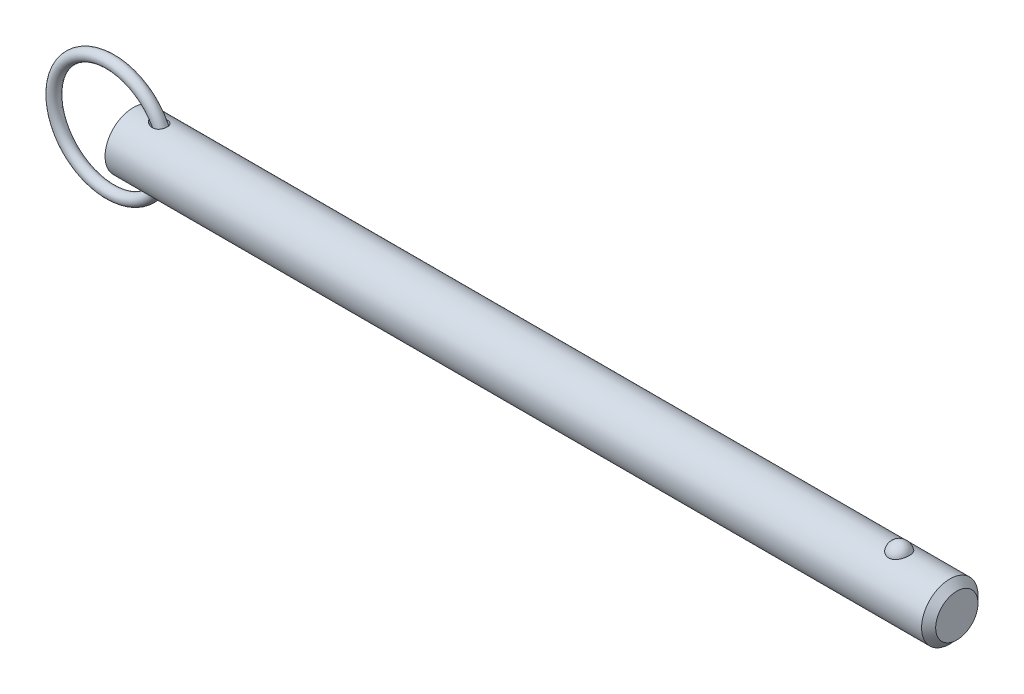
ISO-10303-21;
HEADER;
FILE_DESCRIPTION(('STEP AP214'),'2;1');
FILE_NAME('part.step','',(''),(''),'','','');
FILE_SCHEMA(('AUTOMOTIVE_DESIGN { 1 0 10303 214 1 1 1 1 }'));
ENDSEC;
DATA;
#1=APPLICATION_CONTEXT('core data for automotive mechanical design processes');
#2=APPLICATION_PROTOCOL_DEFINITION('international standard','automotive_design',2000,#1);
#3=PRODUCT_CONTEXT('',#1,'mechanical');
#4=PRODUCT('Part','Part','',(#3));
#5=PRODUCT_RELATED_PRODUCT_CATEGORY('part','',(#4));
#6=PRODUCT_DEFINITION_FORMATION('','',#4);
#7=PRODUCT_DEFINITION_CONTEXT('part definition',#1,'design');
#8=PRODUCT_DEFINITION('design','',#6,#7);
#9=PRODUCT_DEFINITION_SHAPE('','',#8);
#10=(LENGTH_UNIT() NAMED_UNIT(*) SI_UNIT(.MILLI.,.METRE.));
#11=(NAMED_UNIT(*) PLANE_ANGLE_UNIT() SI_UNIT($,.RADIAN.));
#12=(NAMED_UNIT(*) SI_UNIT($,.STERADIAN.) SOLID_ANGLE_UNIT());
#13=UNCERTAINTY_MEASURE_WITH_UNIT(LENGTH_MEASURE(1.E-05),#10,'distance_accuracy_value','');
#14=(GEOMETRIC_REPRESENTATION_CONTEXT(3) GLOBAL_UNCERTAINTY_ASSIGNED_CONTEXT((#13)) GLOBAL_UNIT_ASSIGNED_CONTEXT((#10,
#11,#12)) REPRESENTATION_CONTEXT('',''));
#15=CARTESIAN_POINT('',(0.,0.,0.));
#16=DIRECTION('',(0.,0.,1.));
#17=DIRECTION('',(1.,0.,0.));
#18=AXIS2_PLACEMENT_3D('',#15,#16,#17);
#19=CARTESIAN_POINT('',(-6.46799987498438,0.,0.));
#20=DIRECTION('',(0.,0.,1.));
#21=DIRECTION('',(1.,0.,0.));
#22=AXIS2_PLACEMENT_3D('',#19,#20,#21);
#23=TOROIDAL_SURFACE('',#22,15.875,1.588);
#24=CARTESIAN_POINT('',(10.9950001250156,0.,0.));
#25=VERTEX_POINT('',#24);
#26=VERTEX_LOOP('',#25);
#27=FACE_BOUND('',#26,.T.);
#28=ADVANCED_FACE('P0_F12',(#27),#23,.T.);
#29=CLOSED_SHELL('',(#28));
#30=MANIFOLD_SOLID_BREP('P0_B1',#29);
#31=CARTESIAN_POINT('',(0.,0.,0.));
#32=DIRECTION('',(1.,0.,0.));
#33=DIRECTION('',(0.,0.,-1.));
#34=AXIS2_PLACEMENT_3D('',#31,#32,#33);
#35=CYLINDRICAL_SURFACE('',#34,7.94);
#36=CARTESIAN_POINT('',(5.37881269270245,7.8641200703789,-1.0950869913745));
#37=CARTESIAN_POINT('',(5.49078530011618,7.84653010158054,-1.22142628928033));
#38=CARTESIAN_POINT('',(5.61742164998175,7.82766483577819,-1.33478448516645));
#39=CARTESIAN_POINT('',(5.82155225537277,7.80005811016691,-1.48501770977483));
#40=CARTESIAN_POINT('',(5.89211597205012,7.79095331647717,-1.53186949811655));
#41=CARTESIAN_POINT('',(6.03726296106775,7.77331484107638,-1.61899652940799));
#42=CARTESIAN_POINT('',(6.11184478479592,7.76478095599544,-1.65927412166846));
#43=CARTESIAN_POINT('',(6.31831542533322,7.74290334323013,-1.75933205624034));
#44=CARTESIAN_POINT('',(6.45343253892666,7.73042593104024,-1.81276183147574));
#45=CARTESIAN_POINT('',(6.73017339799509,7.70966096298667,-1.89912673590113));
#46=CARTESIAN_POINT('',(6.87179099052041,7.70136953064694,-1.93208083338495));
#47=CARTESIAN_POINT('',(7.17522096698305,7.6896684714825,-1.97820987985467));
#48=CARTESIAN_POINT('',(7.33750100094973,7.68691980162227,-1.98871513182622));
#49=CARTESIAN_POINT('',(7.57994245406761,7.68880305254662,-1.98137951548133));
#50=CARTESIAN_POINT('',(7.66059155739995,7.69043175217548,-1.97508575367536));
#51=CARTESIAN_POINT('',(7.82077465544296,7.69570110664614,-1.95445819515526));
#52=CARTESIAN_POINT('',(7.9003091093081,7.69934090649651,-1.94012781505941));
#53=CARTESIAN_POINT('',(8.09280087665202,7.71066069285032,-1.89475688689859));
#54=CARTESIAN_POINT('',(8.20465204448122,7.71942251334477,-1.85909462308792));
#55=CARTESIAN_POINT('',(8.42059371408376,7.74035594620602,-1.7699066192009));
#56=CARTESIAN_POINT('',(8.52468939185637,7.75252525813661,-1.7163929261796));
#57=CARTESIAN_POINT('',(8.72211003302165,7.77903750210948,-1.59192358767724));
#58=CARTESIAN_POINT('',(8.81539818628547,7.79338749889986,-1.52091076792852));
#59=CARTESIAN_POINT('',(8.98759177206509,7.8225086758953,-1.36321590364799));
#60=CARTESIAN_POINT('',(9.06649712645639,7.83727985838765,-1.27653377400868));
#61=CARTESIAN_POINT('',(9.20311499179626,7.86453692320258,-1.09567667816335));
#62=CARTESIAN_POINT('',(9.26180839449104,7.8771064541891,-1.00225329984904));
#63=CARTESIAN_POINT('',(9.36257622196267,7.89954213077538,-0.8065472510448));
#64=CARTESIAN_POINT('',(9.40465301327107,7.9094086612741,-0.704265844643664));
#65=CARTESIAN_POINT('',(9.47062404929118,7.92520709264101,-0.495461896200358));
#66=CARTESIAN_POINT('',(9.49478817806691,7.9311972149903,-0.389028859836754));
#67=CARTESIAN_POINT('',(9.52544004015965,7.93883641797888,-0.173494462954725));
#68=CARTESIAN_POINT('',(9.5319278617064,7.94048552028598,-0.0643931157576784));
#69=CARTESIAN_POINT('',(9.52707996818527,7.93926454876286,0.153487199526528));
#70=CARTESIAN_POINT('',(9.51572796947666,7.93639034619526,0.26226578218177));
#71=CARTESIAN_POINT('',(9.47542322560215,7.92642470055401,0.476313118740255));
#72=CARTESIAN_POINT('',(9.44647056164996,7.91933327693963,0.581581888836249));
#73=CARTESIAN_POINT('',(9.3716401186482,7.90170355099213,0.785602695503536));
#74=CARTESIAN_POINT('',(9.32576415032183,7.89116561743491,0.884355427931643));
#75=CARTESIAN_POINT('',(9.21823065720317,7.8677977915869,1.07254831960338));
#76=CARTESIAN_POINT('',(9.15657431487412,7.85496807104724,1.16198917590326));
#77=CARTESIAN_POINT('',(9.01919194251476,7.82843688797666,1.32903649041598));
#78=CARTESIAN_POINT('',(8.94347744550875,7.81473614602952,1.40665255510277));
#79=CARTESIAN_POINT('',(8.78012086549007,7.7879321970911,1.5481977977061));
#80=CARTESIAN_POINT('',(8.69247914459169,7.77482897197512,1.61212739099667));
#81=CARTESIAN_POINT('',(8.50642314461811,7.75037063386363,1.72592270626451));
#82=CARTESIAN_POINT('',(8.40786430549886,7.73904540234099,1.77555777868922));
#83=CARTESIAN_POINT('',(8.2039870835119,7.71943979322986,1.85894844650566));
#84=CARTESIAN_POINT('',(8.0986670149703,7.7111601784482,1.89270006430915));
#85=CARTESIAN_POINT('',(7.87703213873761,7.69782475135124,1.94625652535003));
#86=CARTESIAN_POINT('',(7.76044899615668,7.69301557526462,1.96500324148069));
#87=CARTESIAN_POINT('',(7.52574256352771,7.68770484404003,1.98567257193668));
#88=CARTESIAN_POINT('',(7.40761868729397,7.68720497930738,1.98758858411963));
#89=CARTESIAN_POINT('',(7.15639592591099,7.69044495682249,1.97502233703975));
#90=CARTESIAN_POINT('',(7.02341871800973,7.69476380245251,1.9583009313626));
#91=CARTESIAN_POINT('',(6.7612589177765,7.70776394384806,1.90648094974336));
#92=CARTESIAN_POINT('',(6.6320804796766,7.71644984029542,1.87136299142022));
#93=CARTESIAN_POINT('',(6.35978215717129,7.73875442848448,1.77707737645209));
#94=CARTESIAN_POINT('',(6.2177212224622,7.75293863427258,1.71496895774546));
#95=CARTESIAN_POINT('',(5.94559201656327,7.78383102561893,1.56880760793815));
#96=CARTESIAN_POINT('',(5.81552062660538,7.80053855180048,1.48476040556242));
#97=CARTESIAN_POINT('',(5.60081087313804,7.83035955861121,1.31701356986));
#98=CARTESIAN_POINT('',(5.51265224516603,7.84340226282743,1.23780647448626));
#99=CARTESIAN_POINT('',(5.34976240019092,7.86852524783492,1.06647953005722));
#100=CARTESIAN_POINT('',(5.27500719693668,7.88060722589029,0.974383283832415));
#101=CARTESIAN_POINT('',(5.15877594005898,7.89990441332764,0.800548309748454));
#102=CARTESIAN_POINT('',(5.11360209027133,7.90759876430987,0.721348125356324));
#103=CARTESIAN_POINT('',(5.03655060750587,7.92090267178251,0.556518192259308));
#104=CARTESIAN_POINT('',(5.00466157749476,7.92651401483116,0.470894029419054));
#105=CARTESIAN_POINT('',(4.95653766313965,7.93503671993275,0.294356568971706));
#106=CARTESIAN_POINT('',(4.94043621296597,7.93792505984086,0.203404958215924));
#107=CARTESIAN_POINT('',(4.92605720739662,7.94050250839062,0.0200631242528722));
#108=CARTESIAN_POINT('',(4.92776929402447,7.9401934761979,-0.072326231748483));
#109=CARTESIAN_POINT('',(4.94742735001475,7.93667454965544,-0.24325091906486));
#110=CARTESIAN_POINT('',(4.96327131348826,7.93384031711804,-0.32204819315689));
#111=CARTESIAN_POINT('',(5.00707570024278,7.92609115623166,-0.47605810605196));
#112=CARTESIAN_POINT('',(5.0350396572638,7.92117562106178,-0.551269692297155));
#113=CARTESIAN_POINT('',(5.10737112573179,7.90866290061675,-0.70999547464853));
#114=CARTESIAN_POINT('',(5.15379379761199,7.90074105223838,-0.792541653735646));
#115=CARTESIAN_POINT('',(5.2582083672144,7.88338732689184,-0.949781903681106));
#116=CARTESIAN_POINT('',(5.31621941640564,7.87395295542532,-1.02446265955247));
#117=CARTESIAN_POINT('',(5.37881269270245,7.8641200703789,-1.0950869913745));
#118=B_SPLINE_CURVE_WITH_KNOTS('',3,(#36,#37,#38,#39,#40,#41,#42,#43,#44,#45,#46,#47,#48,#49,
#50,#51,#52,#53,#54,#55,#56,#57,#58,#59,#60,#61,#62,#63,#64,#65,#66,#67,#68,#69,#70,#71,#72,#73,
#74,#75,#76,#77,#78,#79,#80,#81,#82,#83,#84,#85,#86,#87,#88,#89,#90,#91,#92,#93,#94,#95,#96,#97,
#98,#99,#100,#101,#102,#103,#104,#105,#106,#107,#108,#109,#110,#111,#112,#113,#114,#115,#116,
#117),.UNSPECIFIED.,.T.,.F.,(4,2,2,2,2,2,2,2,2,2,2,2,2,2,2,2,2,2,2,2,2,2,2,2,2,2,2,2,2,2,2,2,2,
2,2,2,2,2,2,2,4),(0.,0.508599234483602,0.763935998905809,1.01918131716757,1.45492798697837,
1.89027038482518,2.37502798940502,2.61739702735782,2.8596631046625,3.21120678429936,
3.56251370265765,3.91498401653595,4.26745624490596,4.59897839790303,4.93045331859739,
5.2568264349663,5.58319792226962,5.909867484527,6.23653553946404,6.56316865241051,
6.88977729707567,7.21611917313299,7.54245114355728,7.87378632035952,8.20520442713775,
8.55832700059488,8.91158808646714,9.31234018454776,9.71351536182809,10.1786231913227,
10.6436096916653,11.0001264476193,11.3559986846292,11.6294791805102,11.9027245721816,
12.1782599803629,12.4536351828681,12.693828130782,12.9340911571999,13.2179277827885,
13.5022374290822),.UNSPECIFIED.);
#119=CARTESIAN_POINT('',(5.37881269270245,7.8641200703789,-1.0950869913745));
#120=VERTEX_POINT('',#119);
#121=EDGE_CURVE('P1_E40',#120,#120,#118,.T.);
#122=ORIENTED_EDGE('',*,*,#121,.T.);
#123=EDGE_LOOP('',(#122));
#124=FACE_BOUND('',#123,.T.);
#125=CARTESIAN_POINT('',(229.795,0.,0.));
#126=DIRECTION('',(1.,0.,0.));
#127=DIRECTION('',(0.,0.,-1.));
#128=AXIS2_PLACEMENT_3D('',#125,#126,#127);
#129=CIRCLE('',#128,7.94);
#130=CARTESIAN_POINT('',(229.795,0.,-7.94));
#131=VERTEX_POINT('',#130);
#132=EDGE_CURVE('P1_E25',#131,#131,#129,.T.);
#133=ORIENTED_EDGE('',*,*,#132,.F.);
#134=EDGE_LOOP('',(#133));
#135=FACE_BOUND('',#134,.T.);
#136=CARTESIAN_POINT('',(0.,0.,0.));
#137=DIRECTION('',(1.,0.,0.));
#138=DIRECTION('',(0.,0.,-1.));
#139=AXIS2_PLACEMENT_3D('',#136,#137,#138);
#140=CIRCLE('',#139,7.94);
#141=CARTESIAN_POINT('',(0.,0.,-7.94));
#142=VERTEX_POINT('',#141);
#143=EDGE_CURVE('P1_E9',#142,#142,#140,.T.);
#144=ORIENTED_EDGE('',*,*,#143,.T.);
#145=EDGE_LOOP('',(#144));
#146=FACE_BOUND('',#145,.T.);
#147=CARTESIAN_POINT('',(215.564907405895,7.37767842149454,2.93486986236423));
#148=CARTESIAN_POINT('',(215.412749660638,7.3776732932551,2.93487505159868));
#149=CARTESIAN_POINT('',(215.260632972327,7.38258419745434,2.92262454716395));
#150=CARTESIAN_POINT('',(214.960928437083,7.40163229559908,2.87404196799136));
#151=CARTESIAN_POINT('',(214.813339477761,7.41576720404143,2.83771585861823));
#152=CARTESIAN_POINT('',(214.527018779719,7.45161576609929,2.74218769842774));
#153=CARTESIAN_POINT('',(214.388274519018,7.47331841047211,2.68301886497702));
#154=CARTESIAN_POINT('',(214.122882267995,7.52194082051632,2.54350967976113));
#155=CARTESIAN_POINT('',(213.996236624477,7.54886159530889,2.46316523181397));
#156=CARTESIAN_POINT('',(213.754534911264,7.60594671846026,2.28090375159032));
#157=CARTESIAN_POINT('',(213.639906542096,7.63618114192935,2.1784421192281));
#158=CARTESIAN_POINT('',(213.428878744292,7.69614046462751,1.95608495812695));
#159=CARTESIAN_POINT('',(213.332482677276,7.72586526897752,1.83618622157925));
#160=CARTESIAN_POINT('',(213.155938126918,7.78314821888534,1.57628086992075));
#161=CARTESIAN_POINT('',(213.076707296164,7.81055035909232,1.43561546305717));
#162=CARTESIAN_POINT('',(212.941797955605,7.85879631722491,1.142363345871));
#163=CARTESIAN_POINT('',(212.886121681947,7.87963951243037,0.989775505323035));
#164=CARTESIAN_POINT('',(212.79881215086,7.91289645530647,0.674619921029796));
#165=CARTESIAN_POINT('',(212.76753090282,7.92518652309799,0.511941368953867));
#166=CARTESIAN_POINT('',(212.730975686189,7.93958930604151,0.18324773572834));
#167=CARTESIAN_POINT('',(212.725701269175,7.94170219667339,0.017232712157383));
#168=CARTESIAN_POINT('',(212.741231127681,7.93554931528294,-0.31267286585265));
#169=CARTESIAN_POINT('',(212.761925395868,7.92732732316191,-0.476569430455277));
#170=CARTESIAN_POINT('',(212.82878655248,7.90141534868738,-0.798305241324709));
#171=CARTESIAN_POINT('',(212.874953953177,7.88372517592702,-0.956144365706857));
#172=CARTESIAN_POINT('',(212.991898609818,7.84066230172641,-1.26152073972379));
#173=CARTESIAN_POINT('',(213.062704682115,7.81528060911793,-1.40904568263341));
#174=CARTESIAN_POINT('',(213.227478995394,7.75948672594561,-1.68950598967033));
#175=CARTESIAN_POINT('',(213.321448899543,7.72907417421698,-1.82244030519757));
#176=CARTESIAN_POINT('',(213.530839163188,7.66640424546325,-2.07032792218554));
#177=CARTESIAN_POINT('',(213.646315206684,7.63414223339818,-2.18523308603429));
#178=CARTESIAN_POINT('',(213.8959006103,7.57149681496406,-2.39329737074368));
#179=CARTESIAN_POINT('',(214.030008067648,7.54111321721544,-2.48645870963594));
#180=CARTESIAN_POINT('',(214.310111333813,7.48650742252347,-2.64628132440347));
#181=CARTESIAN_POINT('',(214.455760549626,7.46215900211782,-2.71350554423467));
#182=CARTESIAN_POINT('',(214.757425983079,7.42171253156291,-2.82226614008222));
#183=CARTESIAN_POINT('',(214.913438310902,7.40561140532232,-2.86381209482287));
#184=CARTESIAN_POINT('',(215.222970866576,7.3842679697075,-2.9183907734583));
#185=CARTESIAN_POINT('',(215.376222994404,7.37852109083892,-2.93275024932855));
#186=CARTESIAN_POINT('',(215.683070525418,7.37700973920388,-2.93655208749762));
#187=CARTESIAN_POINT('',(215.836665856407,7.38124333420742,-2.92599927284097));
#188=CARTESIAN_POINT('',(216.134990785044,7.39890635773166,-2.88102897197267));
#189=CARTESIAN_POINT('',(216.279848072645,7.41205491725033,-2.84733999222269));
#190=CARTESIAN_POINT('',(216.56164329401,7.445801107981,-2.75788206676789));
#191=CARTESIAN_POINT('',(216.698580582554,7.46639934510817,-2.70211132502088));
#192=CARTESIAN_POINT('',(216.964061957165,7.51339098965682,-2.56858908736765));
#193=CARTESIAN_POINT('',(217.092354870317,7.53990200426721,-2.4903806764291));
#194=CARTESIAN_POINT('',(217.334244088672,7.59569503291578,-2.31462737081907));
#195=CARTESIAN_POINT('',(217.447837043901,7.6249776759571,-2.21707808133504));
#196=CARTESIAN_POINT('',(217.66322156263,7.68489473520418,-1.99982049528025));
#197=CARTESIAN_POINT('',(217.764148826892,7.71552419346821,-1.87925337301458));
#198=CARTESIAN_POINT('',(217.945186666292,7.77353016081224,-1.6226882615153));
#199=CARTESIAN_POINT('',(218.025293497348,7.80090608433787,-1.48668750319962));
#200=CARTESIAN_POINT('',(218.165361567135,7.85047992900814,-1.1981841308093));
#201=CARTESIAN_POINT('',(218.224587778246,7.87248183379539,-1.04529016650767));
#202=CARTESIAN_POINT('',(218.317982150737,7.90785114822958,-0.731080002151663));
#203=CARTESIAN_POINT('',(218.352149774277,7.92121837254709,-0.56976362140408));
#204=CARTESIAN_POINT('',(218.394795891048,7.93797834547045,-0.242812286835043));
#205=CARTESIAN_POINT('',(218.403204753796,7.94134405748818,-0.0771668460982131));
#206=CARTESIAN_POINT('',(218.393962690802,7.93767937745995,0.253276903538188));
#207=CARTESIAN_POINT('',(218.376312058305,7.93064910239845,0.418075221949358));
#208=CARTESIAN_POINT('',(218.315424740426,7.90695571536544,0.741525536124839));
#209=CARTESIAN_POINT('',(218.272281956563,7.8903279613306,0.900197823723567));
#210=CARTESIAN_POINT('',(218.16135358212,7.84916386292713,1.20759654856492));
#211=CARTESIAN_POINT('',(218.09356656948,7.82462706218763,1.35632241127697));
#212=CARTESIAN_POINT('',(217.934371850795,7.7700669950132,1.64032869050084));
#213=CARTESIAN_POINT('',(217.842861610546,7.7400200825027,1.7755471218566));
#214=CARTESIAN_POINT('',(217.638296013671,7.67774175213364,2.0280064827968));
#215=CARTESIAN_POINT('',(217.525241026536,7.64551037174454,2.14524772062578));
#216=CARTESIAN_POINT('',(217.280831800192,7.58265895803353,2.35778002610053));
#217=CARTESIAN_POINT('',(217.149583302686,7.5520309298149,2.45319004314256));
#218=CARTESIAN_POINT('',(216.871601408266,7.49579792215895,2.61999897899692));
#219=CARTESIAN_POINT('',(216.724867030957,7.47019326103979,2.69139637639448));
#220=CARTESIAN_POINT('',(216.412947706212,7.42622216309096,2.8105324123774));
#221=CARTESIAN_POINT('',(216.247220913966,7.40825002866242,2.85700910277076));
#222=CARTESIAN_POINT('',(215.909279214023,7.38398348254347,2.9191685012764));
#223=CARTESIAN_POINT('',(215.73706702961,7.3776842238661,2.93486399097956));
#224=CARTESIAN_POINT('',(215.564907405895,7.37767842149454,2.93486986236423));
#225=B_SPLINE_CURVE_WITH_KNOTS('',3,(#147,#148,#149,#150,#151,#152,#153,#154,#155,#156,#157,
#158,#159,#160,#161,#162,#163,#164,#165,#166,#167,#168,#169,#170,#171,#172,#173,#174,#175,#176,
#177,#178,#179,#180,#181,#182,#183,#184,#185,#186,#187,#188,#189,#190,#191,#192,#193,#194,#195,
#196,#197,#198,#199,#200,#201,#202,#203,#204,#205,#206,#207,#208,#209,#210,#211,#212,#213,#214,
#215,#216,#217,#218,#219,#220,#221,#222,#223,#224),.UNSPECIFIED.,.T.,.F.,(4,2,2,2,2,2,2,2,2,2,2,
2,2,2,2,2,2,2,2,2,2,2,2,2,2,2,2,2,2,2,2,2,2,2,2,2,2,2,4),(0.,0.455841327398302,
0.911569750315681,1.36663794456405,1.82179423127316,2.28978983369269,2.75787163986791,
3.24685368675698,3.73588214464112,4.23184282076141,4.72779494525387,5.22165321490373,
5.71552141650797,6.2099691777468,6.7044524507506,7.20023431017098,7.69596557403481,
8.18023418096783,8.66432203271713,9.12410697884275,9.58380291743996,10.0296503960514,
10.4755341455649,10.9312349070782,11.3870393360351,11.8654416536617,12.3439299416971,
12.8378875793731,13.3318558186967,13.8271581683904,14.3224549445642,14.8159385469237,
15.3094506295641,15.8051323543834,16.3008055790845,16.7937101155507,17.2866458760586,
17.8026240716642,18.3183879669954),.UNSPECIFIED.);
#226=CARTESIAN_POINT('',(215.564907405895,7.37767842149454,2.93486986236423));
#227=VERTEX_POINT('',#226);
#228=EDGE_CURVE('P1_E34',#227,#227,#225,.T.);
#229=ORIENTED_EDGE('',*,*,#228,.T.);
#230=EDGE_LOOP('',(#229));
#231=FACE_BOUND('',#230,.T.);
#232=CARTESIAN_POINT('',(5.37881269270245,-7.8641200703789,-1.0950869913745));
#233=CARTESIAN_POINT('',(5.31532711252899,-7.87409326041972,-1.02345575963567));
#234=CARTESIAN_POINT('',(5.25654962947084,-7.88365715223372,-0.947641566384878));
#235=CARTESIAN_POINT('',(5.15093536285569,-7.90122221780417,-0.787865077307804));
#236=CARTESIAN_POINT('',(5.10408931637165,-7.90922460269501,-0.703909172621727));
#237=CARTESIAN_POINT('',(5.02499142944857,-7.92292057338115,-0.527991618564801));
#238=CARTESIAN_POINT('',(4.99290048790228,-7.92858863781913,-0.435954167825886));
#239=CARTESIAN_POINT('',(4.94718343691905,-7.93670712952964,-0.247266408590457));
#240=CARTESIAN_POINT('',(4.93353142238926,-7.93916207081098,-0.150622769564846));
#241=CARTESIAN_POINT('',(4.92669426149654,-7.94038957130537,0.0306459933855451));
#242=CARTESIAN_POINT('',(4.93105622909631,-7.93960347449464,0.115182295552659));
#243=CARTESIAN_POINT('',(4.95441758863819,-7.93542535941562,0.282133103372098));
#244=CARTESIAN_POINT('',(4.97342060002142,-7.93203269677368,0.364547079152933));
#245=CARTESIAN_POINT('',(5.02337664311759,-7.92322764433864,0.521528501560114));
#246=CARTESIAN_POINT('',(5.05377582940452,-7.91790920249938,0.596281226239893));
#247=CARTESIAN_POINT('',(5.1246872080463,-7.90571364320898,0.740640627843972));
#248=CARTESIAN_POINT('',(5.16520358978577,-7.89883588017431,0.81024515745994));
#249=CARTESIAN_POINT('',(5.27792634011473,-7.88012470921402,0.978620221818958));
#250=CARTESIAN_POINT('',(5.35563200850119,-7.86757912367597,1.07363778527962));
#251=CARTESIAN_POINT('',(5.52523836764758,-7.84150676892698,1.24994147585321));
#252=CARTESIAN_POINT('',(5.61717506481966,-7.82797755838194,1.33119164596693));
#253=CARTESIAN_POINT('',(5.8391371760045,-7.79742756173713,1.50104748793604));
#254=CARTESIAN_POINT('',(5.9725742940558,-7.78050347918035,1.58521567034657));
#255=CARTESIAN_POINT('',(6.25160600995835,-7.74942135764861,1.73078109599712));
#256=CARTESIAN_POINT('',(6.39720857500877,-7.73526515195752,1.79216327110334));
#257=CARTESIAN_POINT('',(6.69793322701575,-7.7116170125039,1.89134478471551));
#258=CARTESIAN_POINT('',(6.85312134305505,-7.70216275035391,1.92895428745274));
#259=CARTESIAN_POINT('',(7.16781951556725,-7.68988337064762,1.97736316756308));
#260=CARTESIAN_POINT('',(7.32732244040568,-7.68704791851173,1.98820434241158));
#261=CARTESIAN_POINT('',(7.61290770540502,-7.68890797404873,1.98097687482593));
#262=CARTESIAN_POINT('',(7.73913797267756,-7.69217875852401,1.96837928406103));
#263=CARTESIAN_POINT('',(7.98774248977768,-7.70364253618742,1.92303262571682));
#264=CARTESIAN_POINT('',(8.11011880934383,-7.71183283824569,1.89029457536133));
#265=CARTESIAN_POINT('',(8.34766306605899,-7.73253074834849,1.80375920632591));
#266=CARTESIAN_POINT('',(8.46278682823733,-7.74506226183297,1.74984505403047));
#267=CARTESIAN_POINT('',(8.6806268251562,-7.77294147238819,1.62149891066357));
#268=CARTESIAN_POINT('',(8.78334736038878,-7.78828818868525,1.54707406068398));
#269=CARTESIAN_POINT('',(8.96275951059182,-7.81808719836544,1.38814746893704));
#270=CARTESIAN_POINT('',(9.0410292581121,-7.83247448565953,1.30540890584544));
#271=CARTESIAN_POINT('',(9.18176824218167,-7.86008608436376,1.12727331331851));
#272=CARTESIAN_POINT('',(9.24424163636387,-7.87331070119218,1.03187962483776));
#273=CARTESIAN_POINT('',(9.34924815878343,-7.89649032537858,0.835684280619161));
#274=CARTESIAN_POINT('',(9.39252490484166,-7.90656172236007,0.735293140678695));
#275=CARTESIAN_POINT('',(9.46188913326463,-7.92307290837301,0.528458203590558));
#276=CARTESIAN_POINT('',(9.48797767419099,-7.92951292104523,0.422014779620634));
#277=CARTESIAN_POINT('',(9.5222867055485,-7.93804067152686,0.20658939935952));
#278=CARTESIAN_POINT('',(9.53058328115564,-7.94014694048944,0.0976202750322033));
#279=CARTESIAN_POINT('',(9.52935292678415,-7.93983698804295,-0.120212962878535));
#280=CARTESIAN_POINT('',(9.51982577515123,-7.93742071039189,-0.229077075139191));
#281=CARTESIAN_POINT('',(9.48313466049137,-7.92831916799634,-0.44375138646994));
#282=CARTESIAN_POINT('',(9.45594838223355,-7.92162850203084,-0.549557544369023));
#283=CARTESIAN_POINT('',(9.3845465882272,-7.90469917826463,-0.754954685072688));
#284=CARTESIAN_POINT('',(9.34033171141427,-7.89446065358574,-0.854545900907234));
#285=CARTESIAN_POINT('',(9.23602927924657,-7.87157146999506,-1.04456732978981));
#286=CARTESIAN_POINT('',(9.17596171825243,-7.85892385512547,-1.13500888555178));
#287=CARTESIAN_POINT('',(9.04153430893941,-7.83259746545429,-1.30436780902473));
#288=CARTESIAN_POINT('',(8.96717562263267,-7.81891877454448,-1.38328611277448));
#289=CARTESIAN_POINT('',(8.80603455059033,-7.79196869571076,-1.52782923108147));
#290=CARTESIAN_POINT('',(8.71921490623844,-7.77869867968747,-1.59341269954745));
#291=CARTESIAN_POINT('',(8.53589430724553,-7.7539823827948,-1.7096493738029));
#292=CARTESIAN_POINT('',(8.439392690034,-7.74253622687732,-1.76030155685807));
#293=CARTESIAN_POINT('',(8.23614706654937,-7.72219212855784,-1.84754820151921));
#294=CARTESIAN_POINT('',(8.12916866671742,-7.71339202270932,-1.88361685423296));
#295=CARTESIAN_POINT('',(7.91082287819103,-7.69955300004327,-1.93940887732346));
#296=CARTESIAN_POINT('',(7.79945379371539,-7.69451555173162,-1.95912586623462));
#297=CARTESIAN_POINT('',(7.56409927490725,-7.6881073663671,-1.98413612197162));
#298=CARTESIAN_POINT('',(7.43993744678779,-7.68713944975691,-1.98784574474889));
#299=CARTESIAN_POINT('',(7.19239878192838,-7.68969629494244,-1.97792309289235));
#300=CARTESIAN_POINT('',(7.06902225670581,-7.69322274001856,-1.96428432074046));
#301=CARTESIAN_POINT('',(6.80624991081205,-7.70498367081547,-1.91768089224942));
#302=CARTESIAN_POINT('',(6.66736121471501,-7.71386737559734,-1.88203087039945));
#303=CARTESIAN_POINT('',(6.39625444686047,-7.73551250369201,-1.79098714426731));
#304=CARTESIAN_POINT('',(6.26404857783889,-7.74828074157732,-1.73555871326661));
#305=CARTESIAN_POINT('',(6.06559048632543,-7.77003865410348,-1.63446133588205));
#306=CARTESIAN_POINT('',(5.99591479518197,-7.77821880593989,-1.59522999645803));
#307=CARTESIAN_POINT('',(5.86025875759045,-7.79503524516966,-1.51091846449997));
#308=CARTESIAN_POINT('',(5.79427944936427,-7.8036716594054,-1.46583664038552));
#309=CARTESIAN_POINT('',(5.60322733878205,-7.82978128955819,-1.3219827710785));
#310=CARTESIAN_POINT('',(5.48449649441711,-7.84751780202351,-1.21433077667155));
#311=CARTESIAN_POINT('',(5.37881269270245,-7.8641200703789,-1.0950869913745));
#312=B_SPLINE_CURVE_WITH_KNOTS('',3,(#232,#233,#234,#235,#236,#237,#238,#239,#240,#241,#242,
#243,#244,#245,#246,#247,#248,#249,#250,#251,#252,#253,#254,#255,#256,#257,#258,#259,#260,#261,
#262,#263,#264,#265,#266,#267,#268,#269,#270,#271,#272,#273,#274,#275,#276,#277,#278,#279,#280,
#281,#282,#283,#284,#285,#286,#287,#288,#289,#290,#291,#292,#293,#294,#295,#296,#297,#298,#299,
#300,#301,#302,#303,#304,#305,#306,#307,#308,#309,#310,#311),.UNSPECIFIED.,.T.,.F.,(4,2,2,2,2,2,
2,2,2,2,2,2,2,2,2,2,2,2,2,2,2,2,2,2,2,2,2,2,2,2,2,2,2,2,2,2,2,2,2,4),(0.,0.288363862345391,
0.576503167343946,0.867714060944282,1.15851540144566,1.41111828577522,1.66378363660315,
1.90549406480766,2.1473047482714,2.51540453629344,2.88445136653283,3.35805159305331,
3.83196445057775,4.30961543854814,4.78652012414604,5.16565662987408,5.54458592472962,
5.92563591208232,6.30655339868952,6.64920782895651,6.99177197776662,7.31956587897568,
7.64733959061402,7.97370879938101,8.30008206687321,8.62686856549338,8.95364280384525,
9.28000684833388,9.60634436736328,9.93367879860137,10.261035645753,10.59932199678,
10.9377403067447,11.308967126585,11.6803330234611,12.1096921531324,12.5398088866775,
12.7806650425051,13.0215885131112,13.5016249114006),.UNSPECIFIED.);
#313=CARTESIAN_POINT('',(5.37881269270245,-7.8641200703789,-1.0950869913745));
#314=VERTEX_POINT('',#313);
#315=EDGE_CURVE('P1_E17',#314,#314,#312,.T.);
#316=ORIENTED_EDGE('',*,*,#315,.T.);
#317=EDGE_LOOP('',(#316));
#318=FACE_BOUND('',#317,.T.);
#319=ADVANCED_FACE('P1_F13',(#124,#135,#146,#231,#318),#35,.T.);
#320=CARTESIAN_POINT('',(0.,0.,0.));
#321=DIRECTION('',(-1.,0.,0.));
#322=DIRECTION('',(0.,0.,1.));
#323=AXIS2_PLACEMENT_3D('',#320,#321,#322);
#324=PLANE('',#323);
#325=ORIENTED_EDGE('',*,*,#143,.F.);
#326=EDGE_LOOP('',(#325));
#327=FACE_BOUND('',#326,.T.);
#328=ADVANCED_FACE('P1_F15',(#327),#324,.T.);
#329=CARTESIAN_POINT('',(231.78,0.,0.));
#330=DIRECTION('',(-1.,0.,0.));
#331=DIRECTION('',(0.,0.,1.));
#332=AXIS2_PLACEMENT_3D('',#329,#330,#331);
#333=CONICAL_SURFACE('',#332,5.95500000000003,0.785398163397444);
#334=ORIENTED_EDGE('',*,*,#132,.T.);
#335=EDGE_LOOP('',(#334));
#336=FACE_BOUND('',#335,.T.);
#337=CARTESIAN_POINT('',(231.78,0.,0.));
#338=DIRECTION('',(1.,0.,0.));
#339=DIRECTION('',(0.,0.,-1.));
#340=AXIS2_PLACEMENT_3D('',#337,#338,#339);
#341=CIRCLE('',#340,5.95500000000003);
#342=CARTESIAN_POINT('',(231.78,0.,-5.95500000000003));
#343=VERTEX_POINT('',#342);
#344=EDGE_CURVE('P1_E30',#343,#343,#341,.T.);
#345=ORIENTED_EDGE('',*,*,#344,.F.);
#346=EDGE_LOOP('',(#345));
#347=FACE_BOUND('',#346,.T.);
#348=ADVANCED_FACE('P1_F55',(#336,#347),#333,.T.);
#349=CARTESIAN_POINT('',(231.78,5.95500000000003,0.));
#350=DIRECTION('',(1.,0.,0.));
#351=DIRECTION('',(0.,0.,-1.));
#352=AXIS2_PLACEMENT_3D('',#349,#350,#351);
#353=PLANE('',#352);
#354=ORIENTED_EDGE('',*,*,#344,.T.);
#355=EDGE_LOOP('',(#354));
#356=FACE_BOUND('',#355,.T.);
#357=ADVANCED_FACE('P1_F51',(#356),#353,.T.);
#358=CARTESIAN_POINT('',(215.564907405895,7.146,0.));
#359=DIRECTION('',(-1.,0.,0.));
#360=DIRECTION('',(0.,1.,0.));
#361=AXIS2_PLACEMENT_3D('',#358,#359,#360);
#362=SPHERICAL_SURFACE('',#361,2.944);
#363=ORIENTED_EDGE('',*,*,#228,.F.);
#364=EDGE_LOOP('',(#363));
#365=FACE_BOUND('',#364,.T.);
#366=ADVANCED_FACE('P1_F46',(#365),#362,.T.);
#367=CARTESIAN_POINT('',(-6.46799987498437,0.,0.));
#368=DIRECTION('',(0.,0.,1.));
#369=DIRECTION('',(1.,0.,0.));
#370=AXIS2_PLACEMENT_3D('',#367,#368,#369);
#371=TOROIDAL_SURFACE('',#370,15.875,1.985);
#372=ORIENTED_EDGE('',*,*,#315,.F.);
#373=EDGE_LOOP('',(#372));
#374=FACE_BOUND('',#373,.T.);
#375=ORIENTED_EDGE('',*,*,#121,.F.);
#376=EDGE_LOOP('',(#375));
#377=FACE_BOUND('',#376,.T.);
#378=ADVANCED_FACE('P1_F50',(#374,#377),#371,.F.);
#379=CLOSED_SHELL('',(#319,#328,#348,#357,#366,#378));
#380=MANIFOLD_SOLID_BREP('P1_B1',#379);
#381=ADVANCED_BREP_SHAPE_REPRESENTATION('',(#18,#30,#380),#14);
#382=SHAPE_DEFINITION_REPRESENTATION(#9,#381);
ENDSEC;
END-ISO-10303-21;
